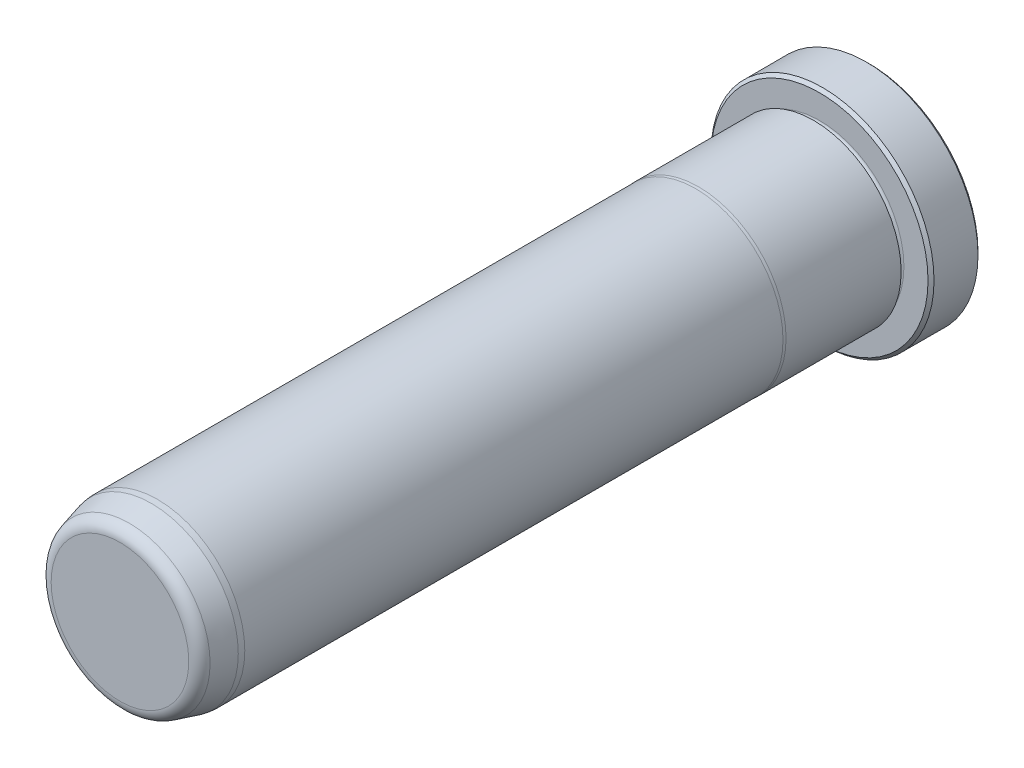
ISO-10303-21;
HEADER;
FILE_DESCRIPTION(('STEP AP214'),'2;1');
FILE_NAME('part.step','',(''),(''),'','','');
FILE_SCHEMA(('AUTOMOTIVE_DESIGN { 1 0 10303 214 1 1 1 1 }'));
ENDSEC;
DATA;
#1=APPLICATION_CONTEXT('core data for automotive mechanical design processes');
#2=APPLICATION_PROTOCOL_DEFINITION('international standard','automotive_design',2000,#1);
#3=PRODUCT_CONTEXT('',#1,'mechanical');
#4=PRODUCT('Part','Part','',(#3));
#5=PRODUCT_RELATED_PRODUCT_CATEGORY('part','',(#4));
#6=PRODUCT_DEFINITION_FORMATION('','',#4);
#7=PRODUCT_DEFINITION_CONTEXT('part definition',#1,'design');
#8=PRODUCT_DEFINITION('design','',#6,#7);
#9=PRODUCT_DEFINITION_SHAPE('','',#8);
#10=(LENGTH_UNIT() NAMED_UNIT(*) SI_UNIT(.MILLI.,.METRE.));
#11=(NAMED_UNIT(*) PLANE_ANGLE_UNIT() SI_UNIT($,.RADIAN.));
#12=(NAMED_UNIT(*) SI_UNIT($,.STERADIAN.) SOLID_ANGLE_UNIT());
#13=UNCERTAINTY_MEASURE_WITH_UNIT(LENGTH_MEASURE(1.E-05),#10,'distance_accuracy_value','');
#14=(GEOMETRIC_REPRESENTATION_CONTEXT(3) GLOBAL_UNCERTAINTY_ASSIGNED_CONTEXT((#13)) GLOBAL_UNIT_ASSIGNED_CONTEXT((#10,
#11,#12)) REPRESENTATION_CONTEXT('',''));
#15=CARTESIAN_POINT('',(0.,0.,0.));
#16=DIRECTION('',(0.,0.,1.));
#17=DIRECTION('',(1.,0.,0.));
#18=AXIS2_PLACEMENT_3D('',#15,#16,#17);
#19=CARTESIAN_POINT('',(0.,0.,0.));
#20=DIRECTION('',(0.,0.,1.));
#21=DIRECTION('',(1.,0.,0.));
#22=AXIS2_PLACEMENT_3D('',#19,#20,#21);
#23=PLANE('',#22);
#24=CARTESIAN_POINT('',(0.,0.,0.));
#25=DIRECTION('',(0.,0.,1.));
#26=DIRECTION('',(1.,0.,0.));
#27=AXIS2_PLACEMENT_3D('',#24,#25,#26);
#28=CIRCLE('',#27,13.7795);
#29=CARTESIAN_POINT('',(13.7795,0.,0.));
#30=VERTEX_POINT('',#29);
#31=EDGE_CURVE('E37',#30,#30,#28,.F.);
#32=ORIENTED_EDGE('',*,*,#31,.T.);
#33=EDGE_LOOP('',(#32));
#34=FACE_BOUND('',#33,.T.);
#35=ADVANCED_FACE('F30',(#34),#23,.F.);
#36=CARTESIAN_POINT('',(0.,0.,0.));
#37=DIRECTION('',(0.,0.,1.));
#38=DIRECTION('',(1.,0.,0.));
#39=AXIS2_PLACEMENT_3D('',#36,#37,#38);
#40=CYLINDRICAL_SURFACE('',#39,14.1605);
#41=CARTESIAN_POINT('',(0.,0.,0.380999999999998));
#42=DIRECTION('',(0.,0.,1.));
#43=DIRECTION('',(1.,0.,0.));
#44=AXIS2_PLACEMENT_3D('',#41,#42,#43);
#45=CIRCLE('',#44,14.1605);
#46=CARTESIAN_POINT('',(14.1605,0.,0.380999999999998));
#47=VERTEX_POINT('',#46);
#48=EDGE_CURVE('E41',#47,#47,#45,.T.);
#49=ORIENTED_EDGE('',*,*,#48,.T.);
#50=EDGE_LOOP('',(#49));
#51=FACE_BOUND('',#50,.T.);
#52=CARTESIAN_POINT('',(0.,0.,5.96900000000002));
#53=DIRECTION('',(0.,0.,-1.));
#54=DIRECTION('',(-1.,0.,0.));
#55=AXIS2_PLACEMENT_3D('',#52,#53,#54);
#56=CIRCLE('',#55,14.1605);
#57=CARTESIAN_POINT('',(-14.1605,0.,5.96900000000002));
#58=VERTEX_POINT('',#57);
#59=EDGE_CURVE('E45',#58,#58,#56,.T.);
#60=ORIENTED_EDGE('',*,*,#59,.T.);
#61=EDGE_LOOP('',(#60));
#62=FACE_BOUND('',#61,.T.);
#63=ADVANCED_FACE('F118',(#51,#62),#40,.T.);
#64=CARTESIAN_POINT('',(0.,14.1605,6.35));
#65=DIRECTION('',(0.,0.,-1.));
#66=DIRECTION('',(-1.,0.,0.));
#67=AXIS2_PLACEMENT_3D('',#64,#65,#66);
#68=PLANE('',#67);
#69=CARTESIAN_POINT('',(0.,0.,6.35));
#70=DIRECTION('',(0.,0.,-1.));
#71=DIRECTION('',(-1.,0.,0.));
#72=AXIS2_PLACEMENT_3D('',#69,#70,#71);
#73=CIRCLE('',#72,13.7795);
#74=CARTESIAN_POINT('',(-13.7795,0.,6.35));
#75=VERTEX_POINT('',#74);
#76=EDGE_CURVE('E10',#75,#75,#73,.F.);
#77=ORIENTED_EDGE('',*,*,#76,.T.);
#78=EDGE_LOOP('',(#77));
#79=FACE_BOUND('',#78,.T.);
#80=CARTESIAN_POINT('',(0.,0.,6.35));
#81=DIRECTION('',(0.,0.,1.));
#82=DIRECTION('',(1.,0.,0.));
#83=AXIS2_PLACEMENT_3D('',#80,#81,#82);
#84=CIRCLE('',#83,10.7188);
#85=CARTESIAN_POINT('',(10.7188,0.,6.35));
#86=VERTEX_POINT('',#85);
#87=EDGE_CURVE('E56',#86,#86,#84,.T.);
#88=ORIENTED_EDGE('',*,*,#87,.F.);
#89=EDGE_LOOP('',(#88));
#90=FACE_BOUND('',#89,.T.);
#91=ADVANCED_FACE('F113',(#79,#90),#68,.F.);
#92=CARTESIAN_POINT('',(0.,0.,6.731));
#93=DIRECTION('',(0.,0.,1.));
#94=DIRECTION('',(1.,0.,0.));
#95=AXIS2_PLACEMENT_3D('',#92,#93,#94);
#96=TOROIDAL_SURFACE('',#95,10.7188,0.381000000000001);
#97=CARTESIAN_POINT('',(0.,0.,7.112));
#98=DIRECTION('',(0.,0.,1.));
#99=DIRECTION('',(1.,0.,0.));
#100=AXIS2_PLACEMENT_3D('',#97,#98,#99);
#101=CIRCLE('',#100,10.7188);
#102=CARTESIAN_POINT('',(10.7188,0.,7.112));
#103=VERTEX_POINT('',#102);
#104=EDGE_CURVE('E59',#103,#103,#101,.T.);
#105=ORIENTED_EDGE('',*,*,#104,.F.);
#106=EDGE_LOOP('',(#105));
#107=FACE_BOUND('',#106,.T.);
#108=ORIENTED_EDGE('',*,*,#87,.T.);
#109=EDGE_LOOP('',(#108));
#110=FACE_BOUND('',#109,.T.);
#111=ADVANCED_FACE('F107',(#107,#110),#96,.F.);
#112=CARTESIAN_POINT('',(0.,10.7188,7.112));
#113=DIRECTION('',(0.,0.,1.));
#114=DIRECTION('',(1.,0.,0.));
#115=AXIS2_PLACEMENT_3D('',#112,#113,#114);
#116=PLANE('',#115);
#117=CARTESIAN_POINT('',(0.,0.,7.112));
#118=DIRECTION('',(0.,0.,1.));
#119=DIRECTION('',(1.,0.,0.));
#120=AXIS2_PLACEMENT_3D('',#117,#118,#119);
#121=CIRCLE('',#120,11.1252);
#122=CARTESIAN_POINT('',(11.1252,0.,7.112));
#123=VERTEX_POINT('',#122);
#124=EDGE_CURVE('E62',#123,#123,#121,.T.);
#125=ORIENTED_EDGE('',*,*,#124,.F.);
#126=EDGE_LOOP('',(#125));
#127=FACE_BOUND('',#126,.T.);
#128=ORIENTED_EDGE('',*,*,#104,.T.);
#129=EDGE_LOOP('',(#128));
#130=FACE_BOUND('',#129,.T.);
#131=ADVANCED_FACE('F101',(#127,#130),#116,.F.);
#132=CARTESIAN_POINT('',(0.,0.,0.));
#133=DIRECTION('',(0.,0.,1.));
#134=DIRECTION('',(1.,0.,0.));
#135=AXIS2_PLACEMENT_3D('',#132,#133,#134);
#136=CYLINDRICAL_SURFACE('',#135,11.1252);
#137=CARTESIAN_POINT('',(0.,0.,21.7347630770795));
#138=DIRECTION('',(0.,0.,1.));
#139=DIRECTION('',(1.,0.,0.));
#140=AXIS2_PLACEMENT_3D('',#137,#138,#139);
#141=CIRCLE('',#140,11.1252);
#142=CARTESIAN_POINT('',(11.1252,0.,21.7347630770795));
#143=VERTEX_POINT('',#142);
#144=EDGE_CURVE('E65',#143,#143,#141,.T.);
#145=ORIENTED_EDGE('',*,*,#144,.F.);
#146=EDGE_LOOP('',(#145));
#147=FACE_BOUND('',#146,.T.);
#148=ORIENTED_EDGE('',*,*,#124,.T.);
#149=EDGE_LOOP('',(#148));
#150=FACE_BOUND('',#149,.T.);
#151=ADVANCED_FACE('F95',(#147,#150),#136,.T.);
#152=CARTESIAN_POINT('',(0.,0.,21.7347630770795));
#153=DIRECTION('',(0.,0.,-1.));
#154=DIRECTION('',(-1.,0.,0.));
#155=AXIS2_PLACEMENT_3D('',#152,#153,#154);
#156=CONICAL_SURFACE('',#155,11.1252,0.0698131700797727);
#157=CARTESIAN_POINT('',(0.,0.,22.098));
#158=DIRECTION('',(0.,0.,1.));
#159=DIRECTION('',(1.,0.,0.));
#160=AXIS2_PLACEMENT_3D('',#157,#158,#159);
#161=CIRCLE('',#160,11.0998);
#162=CARTESIAN_POINT('',(11.0998,0.,22.098));
#163=VERTEX_POINT('',#162);
#164=EDGE_CURVE('E68',#163,#163,#161,.T.);
#165=ORIENTED_EDGE('',*,*,#164,.F.);
#166=EDGE_LOOP('',(#165));
#167=FACE_BOUND('',#166,.T.);
#168=ORIENTED_EDGE('',*,*,#144,.T.);
#169=EDGE_LOOP('',(#168));
#170=FACE_BOUND('',#169,.T.);
#171=ADVANCED_FACE('F89',(#167,#170),#156,.T.);
#172=CARTESIAN_POINT('',(0.,0.,0.));
#173=DIRECTION('',(0.,0.,1.));
#174=DIRECTION('',(1.,0.,0.));
#175=AXIS2_PLACEMENT_3D('',#172,#173,#174);
#176=CYLINDRICAL_SURFACE('',#175,11.0998);
#177=CARTESIAN_POINT('',(0.,0.,90.4875));
#178=DIRECTION('',(0.,0.,1.));
#179=DIRECTION('',(1.,0.,0.));
#180=AXIS2_PLACEMENT_3D('',#177,#178,#179);
#181=CIRCLE('',#180,11.0998);
#182=CARTESIAN_POINT('',(11.0998,0.,90.4875));
#183=VERTEX_POINT('',#182);
#184=EDGE_CURVE('E71',#183,#183,#181,.T.);
#185=ORIENTED_EDGE('',*,*,#184,.F.);
#186=EDGE_LOOP('',(#185));
#187=FACE_BOUND('',#186,.T.);
#188=ORIENTED_EDGE('',*,*,#164,.T.);
#189=EDGE_LOOP('',(#188));
#190=FACE_BOUND('',#189,.T.);
#191=ADVANCED_FACE('F83',(#187,#190),#176,.T.);
#192=CARTESIAN_POINT('',(0.,0.,90.4875));
#193=DIRECTION('',(0.,0.,-1.));
#194=DIRECTION('',(-1.,0.,0.));
#195=AXIS2_PLACEMENT_3D('',#192,#193,#194);
#196=CONICAL_SURFACE('',#195,11.0998,0.0872664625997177);
#197=CARTESIAN_POINT('',(0.,0.,91.2495));
#198=DIRECTION('',(0.,0.,1.));
#199=DIRECTION('',(1.,0.,0.));
#200=AXIS2_PLACEMENT_3D('',#197,#198,#199);
#201=CIRCLE('',#200,11.0331336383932);
#202=CARTESIAN_POINT('',(11.0331336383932,0.,91.2495));
#203=VERTEX_POINT('',#202);
#204=EDGE_CURVE('E74',#203,#203,#201,.T.);
#205=ORIENTED_EDGE('',*,*,#204,.F.);
#206=EDGE_LOOP('',(#205));
#207=FACE_BOUND('',#206,.T.);
#208=ORIENTED_EDGE('',*,*,#184,.T.);
#209=EDGE_LOOP('',(#208));
#210=FACE_BOUND('',#209,.T.);
#211=ADVANCED_FACE('F80',(#207,#210),#196,.T.);
#212=CARTESIAN_POINT('',(0.,0.,91.2495));
#213=DIRECTION('',(0.,0.,-1.));
#214=DIRECTION('',(-1.,0.,0.));
#215=AXIS2_PLACEMENT_3D('',#212,#213,#214);
#216=CONICAL_SURFACE('',#215,11.0331336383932,0.26179938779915);
#217=CARTESIAN_POINT('',(0.,0.,94.0733752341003));
#218=DIRECTION('',(0.,0.,1.));
#219=DIRECTION('',(1.,0.,0.));
#220=AXIS2_PLACEMENT_3D('',#217,#218,#219);
#221=CIRCLE('',#220,10.2764785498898);
#222=CARTESIAN_POINT('',(10.2764785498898,0.,94.0733752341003));
#223=VERTEX_POINT('',#222);
#224=EDGE_CURVE('E50',#223,#223,#221,.F.);
#225=ORIENTED_EDGE('',*,*,#224,.T.);
#226=EDGE_LOOP('',(#225));
#227=FACE_BOUND('',#226,.T.);
#228=ORIENTED_EDGE('',*,*,#204,.T.);
#229=EDGE_LOOP('',(#228));
#230=FACE_BOUND('',#229,.T.);
#231=ADVANCED_FACE('F78',(#227,#230),#216,.T.);
#232=CARTESIAN_POINT('',(0.,9.96120289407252,95.25));
#233=DIRECTION('',(0.,0.,-1.));
#234=DIRECTION('',(-1.,0.,0.));
#235=AXIS2_PLACEMENT_3D('',#232,#233,#234);
#236=PLANE('',#235);
#237=CARTESIAN_POINT('',(0.,0.,95.25));
#238=DIRECTION('',(0.,0.,-1.));
#239=DIRECTION('',(-1.,0.,0.));
#240=AXIS2_PLACEMENT_3D('',#237,#238,#239);
#241=CIRCLE('',#240,8.74307130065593);
#242=CARTESIAN_POINT('',(-8.74307130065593,0.,95.25));
#243=VERTEX_POINT('',#242);
#244=EDGE_CURVE('E53',#243,#243,#241,.F.);
#245=ORIENTED_EDGE('',*,*,#244,.T.);
#246=EDGE_LOOP('',(#245));
#247=FACE_BOUND('',#246,.T.);
#248=ADVANCED_FACE('F133',(#247),#236,.F.);
#249=CARTESIAN_POINT('',(0.,0.,93.6625));
#250=DIRECTION('',(0.,0.,-1.));
#251=DIRECTION('',(-1.,0.,0.));
#252=AXIS2_PLACEMENT_3D('',#249,#250,#251);
#253=TOROIDAL_SURFACE('',#252,8.74307130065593,1.5875);
#254=ORIENTED_EDGE('',*,*,#224,.F.);
#255=EDGE_LOOP('',(#254));
#256=FACE_BOUND('',#255,.T.);
#257=ORIENTED_EDGE('',*,*,#244,.F.);
#258=EDGE_LOOP('',(#257));
#259=FACE_BOUND('',#258,.T.);
#260=ADVANCED_FACE('F130',(#256,#259),#253,.T.);
#261=CARTESIAN_POINT('',(0.,0.,0.380999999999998));
#262=DIRECTION('',(0.,0.,1.));
#263=DIRECTION('',(1.,0.,0.));
#264=AXIS2_PLACEMENT_3D('',#261,#262,#263);
#265=CONICAL_SURFACE('',#264,14.1605,0.785398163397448);
#266=ORIENTED_EDGE('',*,*,#31,.F.);
#267=EDGE_LOOP('',(#266));
#268=FACE_BOUND('',#267,.T.);
#269=ORIENTED_EDGE('',*,*,#48,.F.);
#270=EDGE_LOOP('',(#269));
#271=FACE_BOUND('',#270,.T.);
#272=ADVANCED_FACE('F132',(#268,#271),#265,.T.);
#273=CARTESIAN_POINT('',(0.,0.,6.35));
#274=DIRECTION('',(0.,0.,-1.));
#275=DIRECTION('',(-1.,0.,0.));
#276=AXIS2_PLACEMENT_3D('',#273,#274,#275);
#277=CONICAL_SURFACE('',#276,13.7795,0.785398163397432);
#278=ORIENTED_EDGE('',*,*,#59,.F.);
#279=EDGE_LOOP('',(#278));
#280=FACE_BOUND('',#279,.T.);
#281=ORIENTED_EDGE('',*,*,#76,.F.);
#282=EDGE_LOOP('',(#281));
#283=FACE_BOUND('',#282,.T.);
#284=ADVANCED_FACE('F32',(#280,#283),#277,.T.);
#285=CLOSED_SHELL('',(#35,#63,#91,#111,#131,#151,#171,#191,#211,#231,#248,#260,#272,#284));
#286=MANIFOLD_SOLID_BREP('B2',#285);
#287=ADVANCED_BREP_SHAPE_REPRESENTATION('',(#18,#286),#14);
#288=SHAPE_DEFINITION_REPRESENTATION(#9,#287);
ENDSEC;
END-ISO-10303-21;
